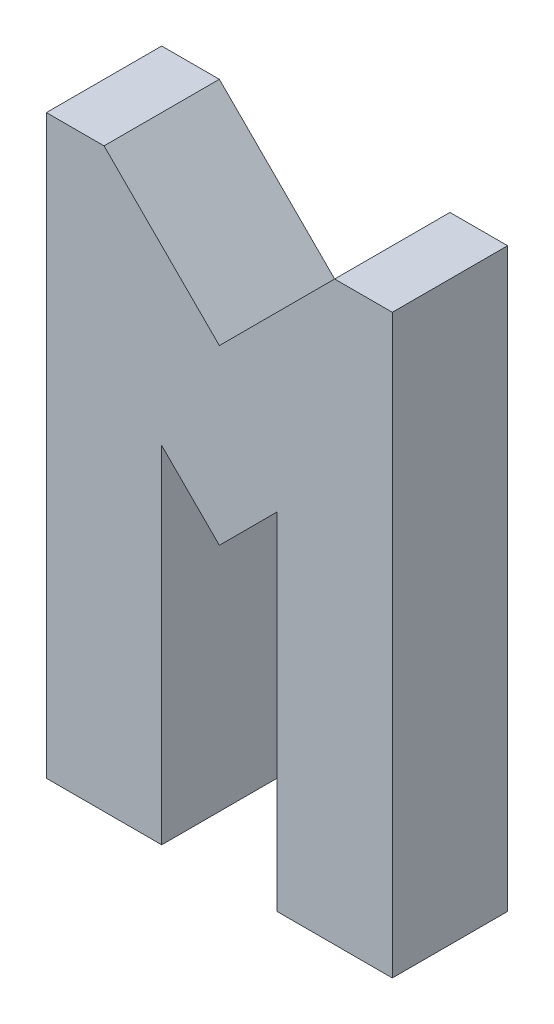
ISO-10303-21;
HEADER;
FILE_DESCRIPTION(('STEP AP214'),'2;1');
FILE_NAME('part.step','',(''),(''),'','','');
FILE_SCHEMA(('AUTOMOTIVE_DESIGN { 1 0 10303 214 1 1 1 1 }'));
ENDSEC;
DATA;
#1=APPLICATION_CONTEXT('core data for automotive mechanical design processes');
#2=APPLICATION_PROTOCOL_DEFINITION('international standard','automotive_design',2000,#1);
#3=PRODUCT_CONTEXT('',#1,'mechanical');
#4=PRODUCT('Part','Part','',(#3));
#5=PRODUCT_RELATED_PRODUCT_CATEGORY('part','',(#4));
#6=PRODUCT_DEFINITION_FORMATION('','',#4);
#7=PRODUCT_DEFINITION_CONTEXT('part definition',#1,'design');
#8=PRODUCT_DEFINITION('design','',#6,#7);
#9=PRODUCT_DEFINITION_SHAPE('','',#8);
#10=(LENGTH_UNIT() NAMED_UNIT(*) SI_UNIT(.MILLI.,.METRE.));
#11=(NAMED_UNIT(*) PLANE_ANGLE_UNIT() SI_UNIT($,.RADIAN.));
#12=(NAMED_UNIT(*) SI_UNIT($,.STERADIAN.) SOLID_ANGLE_UNIT());
#13=UNCERTAINTY_MEASURE_WITH_UNIT(LENGTH_MEASURE(1.E-05),#10,'distance_accuracy_value','');
#14=(GEOMETRIC_REPRESENTATION_CONTEXT(3) GLOBAL_UNCERTAINTY_ASSIGNED_CONTEXT((#13)) GLOBAL_UNIT_ASSIGNED_CONTEXT((#10,
#11,#12)) REPRESENTATION_CONTEXT('',''));
#15=CARTESIAN_POINT('',(0.,0.,0.));
#16=DIRECTION('',(0.,0.,1.));
#17=DIRECTION('',(1.,0.,0.));
#18=AXIS2_PLACEMENT_3D('',#15,#16,#17);
#19=CARTESIAN_POINT('',(0.,0.,10.));
#20=DIRECTION('',(1.,0.,0.));
#21=DIRECTION('',(0.,0.,-1.));
#22=AXIS2_PLACEMENT_3D('',#19,#20,#21);
#23=PLANE('',#22);
#24=DIRECTION('',(0.,-1.,0.));
#25=VECTOR('',#24,1.);
#26=CARTESIAN_POINT('',(0.,0.,0.));
#27=LINE('',#26,#25);
#28=CARTESIAN_POINT('',(0.,50.,0.));
#29=VERTEX_POINT('',#28);
#30=CARTESIAN_POINT('',(0.,0.,0.));
#31=VERTEX_POINT('',#30);
#32=EDGE_CURVE('E153',#29,#31,#27,.T.);
#33=ORIENTED_EDGE('',*,*,#32,.T.);
#34=DIRECTION('',(0.,0.,-1.));
#35=VECTOR('',#34,1.);
#36=CARTESIAN_POINT('',(0.,0.,10.));
#37=LINE('',#36,#35);
#38=CARTESIAN_POINT('',(0.,0.,10.));
#39=VERTEX_POINT('',#38);
#40=EDGE_CURVE('E11',#39,#31,#37,.T.);
#41=ORIENTED_EDGE('',*,*,#40,.F.);
#42=DIRECTION('',(0.,-1.,0.));
#43=VECTOR('',#42,1.);
#44=CARTESIAN_POINT('',(0.,0.,10.));
#45=LINE('',#44,#43);
#46=CARTESIAN_POINT('',(0.,50.,10.));
#47=VERTEX_POINT('',#46);
#48=EDGE_CURVE('E175',#47,#39,#45,.T.);
#49=ORIENTED_EDGE('',*,*,#48,.F.);
#50=DIRECTION('',(0.,0.,-1.));
#51=VECTOR('',#50,1.);
#52=CARTESIAN_POINT('',(0.,50.,10.));
#53=LINE('',#52,#51);
#54=EDGE_CURVE('E149',#47,#29,#53,.T.);
#55=ORIENTED_EDGE('',*,*,#54,.T.);
#56=EDGE_LOOP('',(#33,#41,#49,#55));
#57=FACE_BOUND('',#56,.T.);
#58=ADVANCED_FACE('F33',(#57),#23,.F.);
#59=CARTESIAN_POINT('',(0.,0.,10.));
#60=DIRECTION('',(0.,1.,0.));
#61=DIRECTION('',(0.,0.,1.));
#62=AXIS2_PLACEMENT_3D('',#59,#60,#61);
#63=PLANE('',#62);
#64=DIRECTION('',(1.,0.,0.));
#65=VECTOR('',#64,1.);
#66=CARTESIAN_POINT('',(0.,0.,0.));
#67=LINE('',#66,#65);
#68=CARTESIAN_POINT('',(10.,0.,0.));
#69=VERTEX_POINT('',#68);
#70=EDGE_CURVE('E156',#31,#69,#67,.T.);
#71=ORIENTED_EDGE('',*,*,#70,.T.);
#72=DIRECTION('',(0.,0.,-1.));
#73=VECTOR('',#72,1.);
#74=CARTESIAN_POINT('',(10.,0.,10.));
#75=LINE('',#74,#73);
#76=CARTESIAN_POINT('',(10.,0.,10.));
#77=VERTEX_POINT('',#76);
#78=EDGE_CURVE('E41',#77,#69,#75,.T.);
#79=ORIENTED_EDGE('',*,*,#78,.F.);
#80=DIRECTION('',(1.,0.,0.));
#81=VECTOR('',#80,1.);
#82=CARTESIAN_POINT('',(0.,0.,10.));
#83=LINE('',#82,#81);
#84=EDGE_CURVE('E104',#39,#77,#83,.T.);
#85=ORIENTED_EDGE('',*,*,#84,.F.);
#86=ORIENTED_EDGE('',*,*,#40,.T.);
#87=EDGE_LOOP('',(#71,#79,#85,#86));
#88=FACE_BOUND('',#87,.T.);
#89=ADVANCED_FACE('F253',(#88),#63,.F.);
#90=CARTESIAN_POINT('',(10.,0.,10.));
#91=DIRECTION('',(-1.,0.,0.));
#92=DIRECTION('',(0.,0.,1.));
#93=AXIS2_PLACEMENT_3D('',#90,#91,#92);
#94=PLANE('',#93);
#95=DIRECTION('',(0.,1.,0.));
#96=VECTOR('',#95,1.);
#97=CARTESIAN_POINT('',(10.,0.,0.));
#98=LINE('',#97,#96);
#99=CARTESIAN_POINT('',(10.,30.,0.));
#100=VERTEX_POINT('',#99);
#101=EDGE_CURVE('E158',#69,#100,#98,.T.);
#102=ORIENTED_EDGE('',*,*,#101,.T.);
#103=DIRECTION('',(0.,0.,-1.));
#104=VECTOR('',#103,1.);
#105=CARTESIAN_POINT('',(10.,30.,10.));
#106=LINE('',#105,#104);
#107=CARTESIAN_POINT('',(10.,30.,10.));
#108=VERTEX_POINT('',#107);
#109=EDGE_CURVE('E194',#108,#100,#106,.T.);
#110=ORIENTED_EDGE('',*,*,#109,.F.);
#111=DIRECTION('',(0.,1.,0.));
#112=VECTOR('',#111,1.);
#113=CARTESIAN_POINT('',(10.,0.,10.));
#114=LINE('',#113,#112);
#115=EDGE_CURVE('E202',#77,#108,#114,.T.);
#116=ORIENTED_EDGE('',*,*,#115,.F.);
#117=ORIENTED_EDGE('',*,*,#78,.T.);
#118=EDGE_LOOP('',(#102,#110,#116,#117));
#119=FACE_BOUND('',#118,.T.);
#120=ADVANCED_FACE('F200',(#119),#94,.F.);
#121=CARTESIAN_POINT('',(10.,30.,10.));
#122=DIRECTION('',(0.707106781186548,0.707106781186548,0.));
#123=DIRECTION('',(-0.707106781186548,0.707106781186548,0.));
#124=AXIS2_PLACEMENT_3D('',#121,#122,#123);
#125=PLANE('',#124);
#126=DIRECTION('',(0.707106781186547,-0.707106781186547,0.));
#127=VECTOR('',#126,1.);
#128=CARTESIAN_POINT('',(10.,30.,0.));
#129=LINE('',#128,#127);
#130=CARTESIAN_POINT('',(15.,25.,0.));
#131=VERTEX_POINT('',#130);
#132=EDGE_CURVE('E160',#100,#131,#129,.T.);
#133=ORIENTED_EDGE('',*,*,#132,.T.);
#134=DIRECTION('',(0.,0.,-1.));
#135=VECTOR('',#134,1.);
#136=CARTESIAN_POINT('',(15.,25.,10.));
#137=LINE('',#136,#135);
#138=CARTESIAN_POINT('',(15.,25.,10.));
#139=VERTEX_POINT('',#138);
#140=EDGE_CURVE('E191',#139,#131,#137,.T.);
#141=ORIENTED_EDGE('',*,*,#140,.F.);
#142=DIRECTION('',(0.707106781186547,-0.707106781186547,0.));
#143=VECTOR('',#142,1.);
#144=CARTESIAN_POINT('',(10.,30.,10.));
#145=LINE('',#144,#143);
#146=EDGE_CURVE('E220',#108,#139,#145,.T.);
#147=ORIENTED_EDGE('',*,*,#146,.F.);
#148=ORIENTED_EDGE('',*,*,#109,.T.);
#149=EDGE_LOOP('',(#133,#141,#147,#148));
#150=FACE_BOUND('',#149,.T.);
#151=ADVANCED_FACE('F211',(#150),#125,.F.);
#152=CARTESIAN_POINT('',(20.,30.,10.));
#153=DIRECTION('',(-0.707106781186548,0.707106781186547,0.));
#154=DIRECTION('',(-0.707106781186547,-0.707106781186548,0.));
#155=AXIS2_PLACEMENT_3D('',#152,#153,#154);
#156=PLANE('',#155);
#157=DIRECTION('',(0.707106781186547,0.707106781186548,0.));
#158=VECTOR('',#157,1.);
#159=CARTESIAN_POINT('',(20.,30.,0.));
#160=LINE('',#159,#158);
#161=CARTESIAN_POINT('',(20.,30.,0.));
#162=VERTEX_POINT('',#161);
#163=EDGE_CURVE('E162',#131,#162,#160,.T.);
#164=ORIENTED_EDGE('',*,*,#163,.T.);
#165=DIRECTION('',(0.,0.,-1.));
#166=VECTOR('',#165,1.);
#167=CARTESIAN_POINT('',(20.,30.,10.));
#168=LINE('',#167,#166);
#169=CARTESIAN_POINT('',(20.,30.,10.));
#170=VERTEX_POINT('',#169);
#171=EDGE_CURVE('E188',#170,#162,#168,.T.);
#172=ORIENTED_EDGE('',*,*,#171,.F.);
#173=DIRECTION('',(0.707106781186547,0.707106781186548,0.));
#174=VECTOR('',#173,1.);
#175=CARTESIAN_POINT('',(20.,30.,10.));
#176=LINE('',#175,#174);
#177=EDGE_CURVE('E217',#139,#170,#176,.T.);
#178=ORIENTED_EDGE('',*,*,#177,.F.);
#179=ORIENTED_EDGE('',*,*,#140,.T.);
#180=EDGE_LOOP('',(#164,#172,#178,#179));
#181=FACE_BOUND('',#180,.T.);
#182=ADVANCED_FACE('F215',(#181),#156,.F.);
#183=CARTESIAN_POINT('',(20.,0.,10.));
#184=DIRECTION('',(1.,0.,0.));
#185=DIRECTION('',(0.,1.,0.));
#186=AXIS2_PLACEMENT_3D('',#183,#184,#185);
#187=PLANE('',#186);
#188=DIRECTION('',(0.,-1.,0.));
#189=VECTOR('',#188,1.);
#190=CARTESIAN_POINT('',(20.,0.,0.));
#191=LINE('',#190,#189);
#192=CARTESIAN_POINT('',(20.,0.,0.));
#193=VERTEX_POINT('',#192);
#194=EDGE_CURVE('E164',#162,#193,#191,.T.);
#195=ORIENTED_EDGE('',*,*,#194,.T.);
#196=DIRECTION('',(0.,0.,-1.));
#197=VECTOR('',#196,1.);
#198=CARTESIAN_POINT('',(20.,0.,10.));
#199=LINE('',#198,#197);
#200=CARTESIAN_POINT('',(20.,0.,10.));
#201=VERTEX_POINT('',#200);
#202=EDGE_CURVE('E185',#201,#193,#199,.T.);
#203=ORIENTED_EDGE('',*,*,#202,.F.);
#204=DIRECTION('',(0.,-1.,0.));
#205=VECTOR('',#204,1.);
#206=CARTESIAN_POINT('',(20.,0.,10.));
#207=LINE('',#206,#205);
#208=EDGE_CURVE('E219',#170,#201,#207,.T.);
#209=ORIENTED_EDGE('',*,*,#208,.F.);
#210=ORIENTED_EDGE('',*,*,#171,.T.);
#211=EDGE_LOOP('',(#195,#203,#209,#210));
#212=FACE_BOUND('',#211,.T.);
#213=ADVANCED_FACE('F266',(#212),#187,.F.);
#214=CARTESIAN_POINT('',(20.,0.,10.));
#215=DIRECTION('',(0.,1.,0.));
#216=DIRECTION('',(0.,0.,1.));
#217=AXIS2_PLACEMENT_3D('',#214,#215,#216);
#218=PLANE('',#217);
#219=DIRECTION('',(1.,0.,0.));
#220=VECTOR('',#219,1.);
#221=CARTESIAN_POINT('',(20.,0.,0.));
#222=LINE('',#221,#220);
#223=CARTESIAN_POINT('',(30.,0.,0.));
#224=VERTEX_POINT('',#223);
#225=EDGE_CURVE('E166',#193,#224,#222,.T.);
#226=ORIENTED_EDGE('',*,*,#225,.T.);
#227=DIRECTION('',(0.,0.,-1.));
#228=VECTOR('',#227,1.);
#229=CARTESIAN_POINT('',(30.,0.,10.));
#230=LINE('',#229,#228);
#231=CARTESIAN_POINT('',(30.,0.,10.));
#232=VERTEX_POINT('',#231);
#233=EDGE_CURVE('E182',#232,#224,#230,.T.);
#234=ORIENTED_EDGE('',*,*,#233,.F.);
#235=DIRECTION('',(1.,0.,0.));
#236=VECTOR('',#235,1.);
#237=CARTESIAN_POINT('',(20.,0.,10.));
#238=LINE('',#237,#236);
#239=EDGE_CURVE('E222',#201,#232,#238,.T.);
#240=ORIENTED_EDGE('',*,*,#239,.F.);
#241=ORIENTED_EDGE('',*,*,#202,.T.);
#242=EDGE_LOOP('',(#226,#234,#240,#241));
#243=FACE_BOUND('',#242,.T.);
#244=ADVANCED_FACE('F269',(#243),#218,.F.);
#245=CARTESIAN_POINT('',(30.,0.,10.));
#246=DIRECTION('',(-1.,0.,0.));
#247=DIRECTION('',(0.,0.,1.));
#248=AXIS2_PLACEMENT_3D('',#245,#246,#247);
#249=PLANE('',#248);
#250=DIRECTION('',(0.,1.,0.));
#251=VECTOR('',#250,1.);
#252=CARTESIAN_POINT('',(30.,0.,0.));
#253=LINE('',#252,#251);
#254=CARTESIAN_POINT('',(30.,50.,0.));
#255=VERTEX_POINT('',#254);
#256=EDGE_CURVE('E168',#224,#255,#253,.T.);
#257=ORIENTED_EDGE('',*,*,#256,.T.);
#258=DIRECTION('',(0.,0.,-1.));
#259=VECTOR('',#258,1.);
#260=CARTESIAN_POINT('',(30.,50.,10.));
#261=LINE('',#260,#259);
#262=CARTESIAN_POINT('',(30.,50.,10.));
#263=VERTEX_POINT('',#262);
#264=EDGE_CURVE('E179',#263,#255,#261,.T.);
#265=ORIENTED_EDGE('',*,*,#264,.F.);
#266=DIRECTION('',(0.,1.,0.));
#267=VECTOR('',#266,1.);
#268=CARTESIAN_POINT('',(30.,0.,10.));
#269=LINE('',#268,#267);
#270=EDGE_CURVE('E228',#232,#263,#269,.T.);
#271=ORIENTED_EDGE('',*,*,#270,.F.);
#272=ORIENTED_EDGE('',*,*,#233,.T.);
#273=EDGE_LOOP('',(#257,#265,#271,#272));
#274=FACE_BOUND('',#273,.T.);
#275=ADVANCED_FACE('F234',(#274),#249,.F.);
#276=CARTESIAN_POINT('',(25.,50.,10.));
#277=DIRECTION('',(0.,-1.,0.));
#278=DIRECTION('',(0.,0.,-1.));
#279=AXIS2_PLACEMENT_3D('',#276,#277,#278);
#280=PLANE('',#279);
#281=DIRECTION('',(-1.,0.,0.));
#282=VECTOR('',#281,1.);
#283=CARTESIAN_POINT('',(25.,50.,0.));
#284=LINE('',#283,#282);
#285=CARTESIAN_POINT('',(25.,50.,0.));
#286=VERTEX_POINT('',#285);
#287=EDGE_CURVE('E170',#255,#286,#284,.T.);
#288=ORIENTED_EDGE('',*,*,#287,.T.);
#289=DIRECTION('',(0.,0.,-1.));
#290=VECTOR('',#289,1.);
#291=CARTESIAN_POINT('',(25.,50.,10.));
#292=LINE('',#291,#290);
#293=CARTESIAN_POINT('',(25.,50.,10.));
#294=VERTEX_POINT('',#293);
#295=EDGE_CURVE('E144',#294,#286,#292,.T.);
#296=ORIENTED_EDGE('',*,*,#295,.F.);
#297=DIRECTION('',(-1.,0.,0.));
#298=VECTOR('',#297,1.);
#299=CARTESIAN_POINT('',(25.,50.,10.));
#300=LINE('',#299,#298);
#301=EDGE_CURVE('E135',#263,#294,#300,.T.);
#302=ORIENTED_EDGE('',*,*,#301,.F.);
#303=ORIENTED_EDGE('',*,*,#264,.T.);
#304=EDGE_LOOP('',(#288,#296,#302,#303));
#305=FACE_BOUND('',#304,.T.);
#306=ADVANCED_FACE('F238',(#305),#280,.F.);
#307=CARTESIAN_POINT('',(25.,50.,10.));
#308=DIRECTION('',(0.707106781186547,-0.707106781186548,0.));
#309=DIRECTION('',(0.707106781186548,0.707106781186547,0.));
#310=AXIS2_PLACEMENT_3D('',#307,#308,#309);
#311=PLANE('',#310);
#312=DIRECTION('',(-0.707106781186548,-0.707106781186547,0.));
#313=VECTOR('',#312,1.);
#314=CARTESIAN_POINT('',(25.,50.,0.));
#315=LINE('',#314,#313);
#316=CARTESIAN_POINT('',(15.,40.,0.));
#317=VERTEX_POINT('',#316);
#318=EDGE_CURVE('E143',#286,#317,#315,.T.);
#319=ORIENTED_EDGE('',*,*,#318,.T.);
#320=DIRECTION('',(0.,0.,-1.));
#321=VECTOR('',#320,1.);
#322=CARTESIAN_POINT('',(15.,40.,10.));
#323=LINE('',#322,#321);
#324=CARTESIAN_POINT('',(15.,40.,10.));
#325=VERTEX_POINT('',#324);
#326=EDGE_CURVE('E140',#325,#317,#323,.T.);
#327=ORIENTED_EDGE('',*,*,#326,.F.);
#328=DIRECTION('',(-0.707106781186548,-0.707106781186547,0.));
#329=VECTOR('',#328,1.);
#330=CARTESIAN_POINT('',(25.,50.,10.));
#331=LINE('',#330,#329);
#332=EDGE_CURVE('E129',#294,#325,#331,.T.);
#333=ORIENTED_EDGE('',*,*,#332,.F.);
#334=ORIENTED_EDGE('',*,*,#295,.T.);
#335=EDGE_LOOP('',(#319,#327,#333,#334));
#336=FACE_BOUND('',#335,.T.);
#337=ADVANCED_FACE('F141',(#336),#311,.F.);
#338=CARTESIAN_POINT('',(5.,50.,10.));
#339=DIRECTION('',(-0.707106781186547,-0.707106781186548,0.));
#340=DIRECTION('',(0.707106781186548,-0.707106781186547,0.));
#341=AXIS2_PLACEMENT_3D('',#338,#339,#340);
#342=PLANE('',#341);
#343=DIRECTION('',(-0.707106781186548,0.707106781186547,0.));
#344=VECTOR('',#343,1.);
#345=CARTESIAN_POINT('',(5.,50.,0.));
#346=LINE('',#345,#344);
#347=CARTESIAN_POINT('',(5.,50.,0.));
#348=VERTEX_POINT('',#347);
#349=EDGE_CURVE('E90',#317,#348,#346,.T.);
#350=ORIENTED_EDGE('',*,*,#349,.T.);
#351=DIRECTION('',(0.,0.,-1.));
#352=VECTOR('',#351,1.);
#353=CARTESIAN_POINT('',(5.,50.,10.));
#354=LINE('',#353,#352);
#355=CARTESIAN_POINT('',(5.,50.,10.));
#356=VERTEX_POINT('',#355);
#357=EDGE_CURVE('E145',#356,#348,#354,.T.);
#358=ORIENTED_EDGE('',*,*,#357,.F.);
#359=DIRECTION('',(-0.707106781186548,0.707106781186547,0.));
#360=VECTOR('',#359,1.);
#361=CARTESIAN_POINT('',(5.,50.,10.));
#362=LINE('',#361,#360);
#363=EDGE_CURVE('E133',#325,#356,#362,.T.);
#364=ORIENTED_EDGE('',*,*,#363,.F.);
#365=ORIENTED_EDGE('',*,*,#326,.T.);
#366=EDGE_LOOP('',(#350,#358,#364,#365));
#367=FACE_BOUND('',#366,.T.);
#368=ADVANCED_FACE('F147',(#367),#342,.F.);
#369=CARTESIAN_POINT('',(0.,50.,10.));
#370=DIRECTION('',(0.,-1.,0.));
#371=DIRECTION('',(0.,0.,-1.));
#372=AXIS2_PLACEMENT_3D('',#369,#370,#371);
#373=PLANE('',#372);
#374=DIRECTION('',(-1.,0.,0.));
#375=VECTOR('',#374,1.);
#376=CARTESIAN_POINT('',(0.,50.,0.));
#377=LINE('',#376,#375);
#378=EDGE_CURVE('E96',#348,#29,#377,.T.);
#379=ORIENTED_EDGE('',*,*,#378,.T.);
#380=ORIENTED_EDGE('',*,*,#54,.F.);
#381=DIRECTION('',(-1.,0.,0.));
#382=VECTOR('',#381,1.);
#383=CARTESIAN_POINT('',(0.,50.,10.));
#384=LINE('',#383,#382);
#385=EDGE_CURVE('E49',#356,#47,#384,.T.);
#386=ORIENTED_EDGE('',*,*,#385,.F.);
#387=ORIENTED_EDGE('',*,*,#357,.T.);
#388=EDGE_LOOP('',(#379,#380,#386,#387));
#389=FACE_BOUND('',#388,.T.);
#390=ADVANCED_FACE('F242',(#389),#373,.F.);
#391=CARTESIAN_POINT('',(0.,0.,10.));
#392=DIRECTION('',(0.,0.,-1.));
#393=DIRECTION('',(-1.,0.,0.));
#394=AXIS2_PLACEMENT_3D('',#391,#392,#393);
#395=PLANE('',#394);
#396=ORIENTED_EDGE('',*,*,#48,.T.);
#397=ORIENTED_EDGE('',*,*,#84,.T.);
#398=ORIENTED_EDGE('',*,*,#115,.T.);
#399=ORIENTED_EDGE('',*,*,#146,.T.);
#400=ORIENTED_EDGE('',*,*,#177,.T.);
#401=ORIENTED_EDGE('',*,*,#208,.T.);
#402=ORIENTED_EDGE('',*,*,#239,.T.);
#403=ORIENTED_EDGE('',*,*,#270,.T.);
#404=ORIENTED_EDGE('',*,*,#301,.T.);
#405=ORIENTED_EDGE('',*,*,#332,.T.);
#406=ORIENTED_EDGE('',*,*,#363,.T.);
#407=ORIENTED_EDGE('',*,*,#385,.T.);
#408=EDGE_LOOP('',(#396,#397,#398,#399,#400,#401,#402,#403,#404,#405,#406,#407));
#409=FACE_BOUND('',#408,.T.);
#410=ADVANCED_FACE('F131',(#409),#395,.F.);
#411=CARTESIAN_POINT('',(0.,0.,0.));
#412=DIRECTION('',(0.,0.,-1.));
#413=DIRECTION('',(-1.,0.,0.));
#414=AXIS2_PLACEMENT_3D('',#411,#412,#413);
#415=PLANE('',#414);
#416=ORIENTED_EDGE('',*,*,#32,.F.);
#417=ORIENTED_EDGE('',*,*,#378,.F.);
#418=ORIENTED_EDGE('',*,*,#349,.F.);
#419=ORIENTED_EDGE('',*,*,#318,.F.);
#420=ORIENTED_EDGE('',*,*,#287,.F.);
#421=ORIENTED_EDGE('',*,*,#256,.F.);
#422=ORIENTED_EDGE('',*,*,#225,.F.);
#423=ORIENTED_EDGE('',*,*,#194,.F.);
#424=ORIENTED_EDGE('',*,*,#163,.F.);
#425=ORIENTED_EDGE('',*,*,#132,.F.);
#426=ORIENTED_EDGE('',*,*,#101,.F.);
#427=ORIENTED_EDGE('',*,*,#70,.F.);
#428=EDGE_LOOP('',(#416,#417,#418,#419,#420,#421,#422,#423,#424,#425,#426,#427));
#429=FACE_BOUND('',#428,.T.);
#430=ADVANCED_FACE('F206',(#429),#415,.T.);
#431=CLOSED_SHELL('',(#58,#89,#120,#151,#182,#213,#244,#275,#306,#337,#368,#390,#410,#430));
#432=MANIFOLD_SOLID_BREP('B2',#431);
#433=ADVANCED_BREP_SHAPE_REPRESENTATION('',(#18,#432),#14);
#434=SHAPE_DEFINITION_REPRESENTATION(#9,#433);
ENDSEC;
END-ISO-10303-21;
